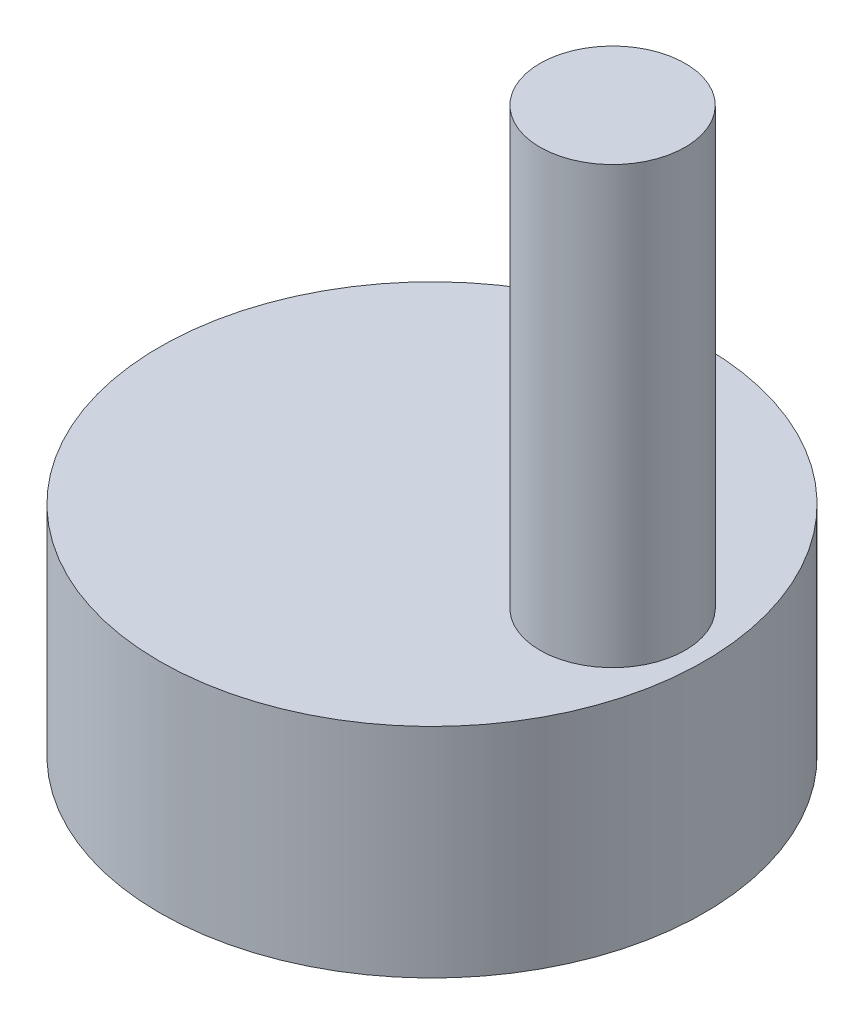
ISO-10303-21;
HEADER;
FILE_DESCRIPTION(('STEP AP214'),'2;1');
FILE_NAME('part.step','',(''),(''),'','','');
FILE_SCHEMA(('AUTOMOTIVE_DESIGN { 1 0 10303 214 1 1 1 1 }'));
ENDSEC;
DATA;
#1=APPLICATION_CONTEXT('core data for automotive mechanical design processes');
#2=APPLICATION_PROTOCOL_DEFINITION('international standard','automotive_design',2000,#1);
#3=PRODUCT_CONTEXT('',#1,'mechanical');
#4=PRODUCT('Part','Part','',(#3));
#5=PRODUCT_RELATED_PRODUCT_CATEGORY('part','',(#4));
#6=PRODUCT_DEFINITION_FORMATION('','',#4);
#7=PRODUCT_DEFINITION_CONTEXT('part definition',#1,'design');
#8=PRODUCT_DEFINITION('design','',#6,#7);
#9=PRODUCT_DEFINITION_SHAPE('','',#8);
#10=(LENGTH_UNIT() NAMED_UNIT(*) SI_UNIT(.MILLI.,.METRE.));
#11=(NAMED_UNIT(*) PLANE_ANGLE_UNIT() SI_UNIT($,.RADIAN.));
#12=(NAMED_UNIT(*) SI_UNIT($,.STERADIAN.) SOLID_ANGLE_UNIT());
#13=UNCERTAINTY_MEASURE_WITH_UNIT(LENGTH_MEASURE(1.E-05),#10,'distance_accuracy_value','');
#14=(GEOMETRIC_REPRESENTATION_CONTEXT(3) GLOBAL_UNCERTAINTY_ASSIGNED_CONTEXT((#13)) GLOBAL_UNIT_ASSIGNED_CONTEXT((#10,
#11,#12)) REPRESENTATION_CONTEXT('',''));
#15=CARTESIAN_POINT('',(0.,0.,0.));
#16=DIRECTION('',(0.,0.,1.));
#17=DIRECTION('',(1.,0.,0.));
#18=AXIS2_PLACEMENT_3D('',#15,#16,#17);
#19=CARTESIAN_POINT('',(0.,3.,0.));
#20=DIRECTION('',(0.,1.,0.));
#21=DIRECTION('',(0.,0.,1.));
#22=AXIS2_PLACEMENT_3D('',#19,#20,#21);
#23=PLANE('',#22);
#24=CARTESIAN_POINT('',(0.,3.,0.));
#25=DIRECTION('',(0.,1.,0.));
#26=DIRECTION('',(0.,0.,1.));
#27=AXIS2_PLACEMENT_3D('',#24,#25,#26);
#28=CIRCLE('',#27,3.75);
#29=CARTESIAN_POINT('',(0.,3.,3.75));
#30=VERTEX_POINT('',#29);
#31=EDGE_CURVE('E10',#30,#30,#28,.T.);
#32=ORIENTED_EDGE('',*,*,#31,.T.);
#33=EDGE_LOOP('',(#32));
#34=FACE_BOUND('',#33,.T.);
#35=CARTESIAN_POINT('',(2.4868,3.,0.));
#36=DIRECTION('',(0.,1.,0.));
#37=DIRECTION('',(0.,0.,1.));
#38=AXIS2_PLACEMENT_3D('',#35,#36,#37);
#39=CIRCLE('',#38,1.);
#40=CARTESIAN_POINT('',(2.4868,3.,1.));
#41=VERTEX_POINT('',#40);
#42=EDGE_CURVE('E46',#41,#41,#39,.T.);
#43=ORIENTED_EDGE('',*,*,#42,.F.);
#44=EDGE_LOOP('',(#43));
#45=FACE_BOUND('',#44,.T.);
#46=ADVANCED_FACE('F33',(#34,#45),#23,.T.);
#47=CARTESIAN_POINT('',(0.,3.,0.));
#48=DIRECTION('',(0.,-1.,0.));
#49=DIRECTION('',(0.,0.,-1.));
#50=AXIS2_PLACEMENT_3D('',#47,#48,#49);
#51=CYLINDRICAL_SURFACE('',#50,3.75);
#52=ORIENTED_EDGE('',*,*,#31,.F.);
#53=EDGE_LOOP('',(#52));
#54=FACE_BOUND('',#53,.T.);
#55=CARTESIAN_POINT('',(0.,0.,0.));
#56=DIRECTION('',(0.,1.,0.));
#57=DIRECTION('',(0.,0.,1.));
#58=AXIS2_PLACEMENT_3D('',#55,#56,#57);
#59=CIRCLE('',#58,3.75);
#60=CARTESIAN_POINT('',(0.,0.,3.75));
#61=VERTEX_POINT('',#60);
#62=EDGE_CURVE('E37',#61,#61,#59,.T.);
#63=ORIENTED_EDGE('',*,*,#62,.T.);
#64=EDGE_LOOP('',(#63));
#65=FACE_BOUND('',#64,.T.);
#66=ADVANCED_FACE('F35',(#54,#65),#51,.T.);
#67=CARTESIAN_POINT('',(0.,0.,0.));
#68=DIRECTION('',(0.,1.,0.));
#69=DIRECTION('',(0.,0.,1.));
#70=AXIS2_PLACEMENT_3D('',#67,#68,#69);
#71=PLANE('',#70);
#72=ORIENTED_EDGE('',*,*,#62,.F.);
#73=EDGE_LOOP('',(#72));
#74=FACE_BOUND('',#73,.T.);
#75=ADVANCED_FACE('F57',(#74),#71,.F.);
#76=CARTESIAN_POINT('',(2.4868,9.,0.));
#77=DIRECTION('',(0.,-1.,0.));
#78=DIRECTION('',(0.,0.,-1.));
#79=AXIS2_PLACEMENT_3D('',#76,#77,#78);
#80=CYLINDRICAL_SURFACE('',#79,1.);
#81=CARTESIAN_POINT('',(2.4868,9.,0.));
#82=DIRECTION('',(0.,1.,0.));
#83=DIRECTION('',(0.,0.,1.));
#84=AXIS2_PLACEMENT_3D('',#81,#82,#83);
#85=CIRCLE('',#84,1.);
#86=CARTESIAN_POINT('',(2.4868,9.,1.));
#87=VERTEX_POINT('',#86);
#88=EDGE_CURVE('E44',#87,#87,#85,.T.);
#89=ORIENTED_EDGE('',*,*,#88,.F.);
#90=EDGE_LOOP('',(#89));
#91=FACE_BOUND('',#90,.T.);
#92=ORIENTED_EDGE('',*,*,#42,.T.);
#93=EDGE_LOOP('',(#92));
#94=FACE_BOUND('',#93,.T.);
#95=ADVANCED_FACE('F54',(#91,#94),#80,.T.);
#96=CARTESIAN_POINT('',(2.4868,9.,0.));
#97=DIRECTION('',(0.,1.,0.));
#98=DIRECTION('',(0.,0.,1.));
#99=AXIS2_PLACEMENT_3D('',#96,#97,#98);
#100=PLANE('',#99);
#101=ORIENTED_EDGE('',*,*,#88,.T.);
#102=EDGE_LOOP('',(#101));
#103=FACE_BOUND('',#102,.T.);
#104=ADVANCED_FACE('F52',(#103),#100,.T.);
#105=CLOSED_SHELL('',(#46,#66,#75,#95,#104));
#106=MANIFOLD_SOLID_BREP('B2',#105);
#107=ADVANCED_BREP_SHAPE_REPRESENTATION('',(#18,#106),#14);
#108=SHAPE_DEFINITION_REPRESENTATION(#9,#107);
ENDSEC;
END-ISO-10303-21;
